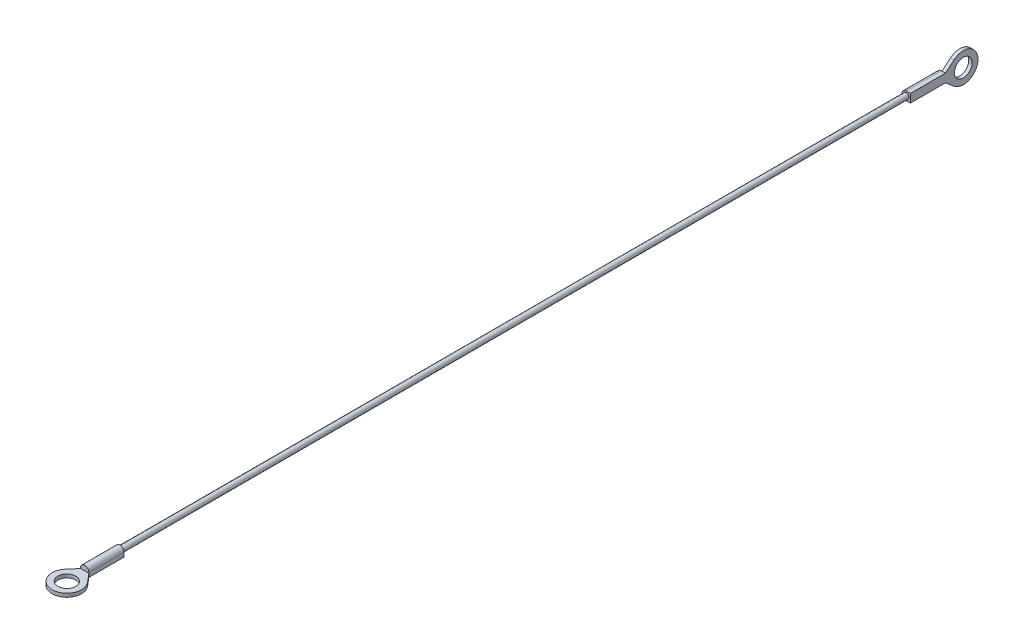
from build123d import *

# Parameters (mm, degrees)
SKETCH1_R           = 0.795
BOSS_EXTRUDE1_DEPTH = 111.92
BOSS_EXTRUDE2_DEPTH = 10
SKETCH3_R           = 2.54
BOSS_EXTRUDE3_DEPTH = 1.01
BOSS_EXTRUDE4_START = 10
BOSS_EXTRUDE4_DEPTH = 10
SKETCH5_R           = 2.54
BOSS_EXTRUDE5_DEPTH = 1.01


with BuildPart() as part:
    # Sketch1 → Boss-Extrude1 (new, symmetric)
    with BuildSketch(Plane.XY):
        Circle(SKETCH1_R)
    extrude(amount=BOSS_EXTRUDE1_DEPTH, both=True)

    # Sketch2 → Boss-Extrude2 (add)
    with BuildSketch(Plane.XY.offset(111.92)):
        with BuildLine():
            Line((-1.195, 0), (-1.195, -1.195))
            Line((-1.195, -1.195), (0, -1.195))
            Line((0, -1.195), (1.195, -1.195))
            Line((1.195, -1.195), (1.195, 0))
            ThreePointArc((1.195, 0), (0, 1.195), (-1.195, 0))
        make_face()
    extrude(amount=BOSS_EXTRUDE2_DEPTH)

    # Sketch3 → Boss-Extrude3 (add)
    with BuildSketch(Plane.XZ.offset(1.195)):
        with BuildLine():
            Line((1.195, 121.92), (3.201749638, 124.297242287))
            ThreePointArc((3.201749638, 124.297242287), (0, 131.19), (-3.201749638, 124.297242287))
            Line((-3.201749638, 124.297242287), (-1.195, 121.92))
            Line((-1.195, 121.92), (1.195, 121.92))
        make_face()
        with Locations(Location((0, 127, 0), (0, 0, 270))):
            Circle(SKETCH3_R, mode=Mode.SUBTRACT)
    extrude(amount=-BOSS_EXTRUDE3_DEPTH)

    # Sketch4 → Boss-Extrude4 (add)
    with BuildSketch(Plane(origin=(0, 0, -111.92), x_dir=(-1, 0, 0), z_dir=(0, 0, -1)).offset(BOSS_EXTRUDE4_START)):
        with BuildLine():
            Line((0, 1.195), (-1.195, 1.195))
            Line((-1.195, 1.195), (-1.195, 0))
            Line((-1.195, 0), (-1.195, -1.195))
            Line((-1.195, -1.195), (0, -1.195))
            ThreePointArc((0, -1.195), (1.195, 0), (0, 1.195))
        make_face()
    extrude(amount=-BOSS_EXTRUDE4_DEPTH)

    # Sketch5 → Boss-Extrude5 (add)
    with BuildSketch(Plane(origin=(1.195, 0, 0), x_dir=(0, 0, -1), z_dir=(1, 0, 0))):
        with BuildLine():
            Line((121.92, -1.195), (121.92, 1.195))
            Line((121.92, 1.195), (124.297242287, 3.201749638))
            ThreePointArc((124.297242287, 3.201749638), (131.19, 0), (124.297242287, -3.201749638))
            Line((124.297242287, -3.201749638), (121.92, -1.195))
        make_face()
        with Locations((127, 0)):
            Circle(SKETCH5_R, mode=Mode.SUBTRACT)
    extrude(amount=-BOSS_EXTRUDE5_DEPTH)


solid = part.part
